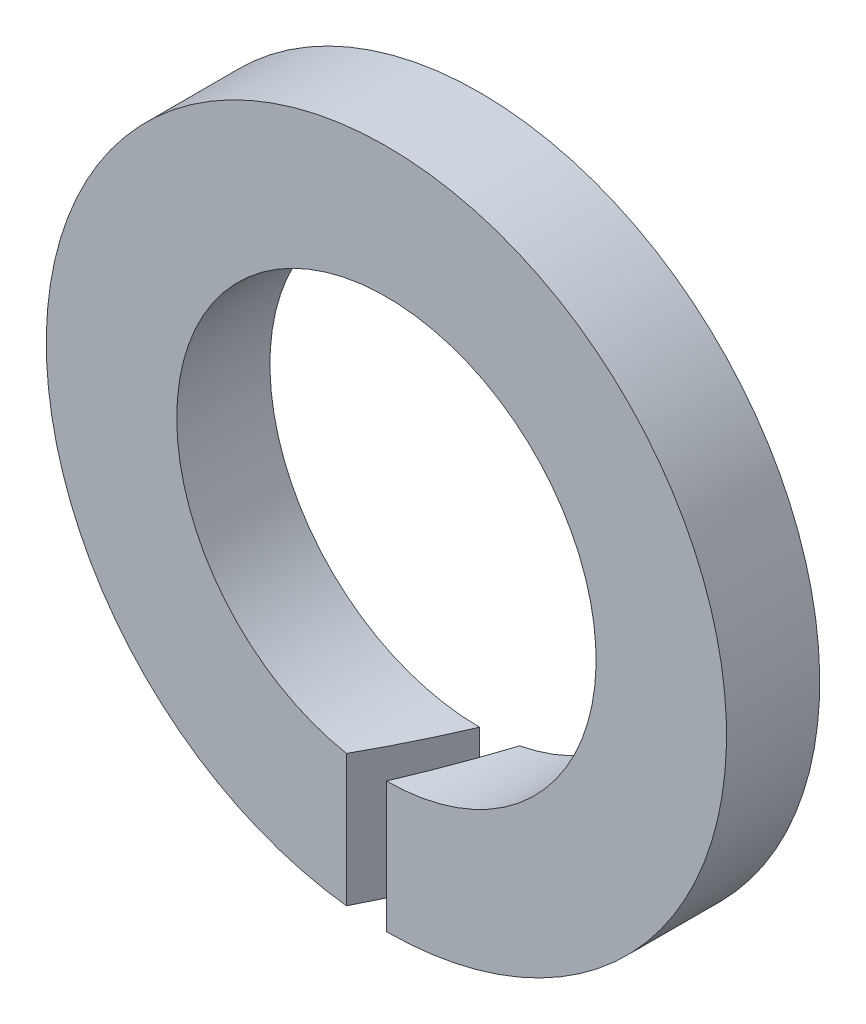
ISO-10303-21;
HEADER;
FILE_DESCRIPTION(('STEP AP214'),'2;1');
FILE_NAME('part.step','',(''),(''),'','','');
FILE_SCHEMA(('AUTOMOTIVE_DESIGN { 1 0 10303 214 1 1 1 1 }'));
ENDSEC;
DATA;
#1=APPLICATION_CONTEXT('core data for automotive mechanical design processes');
#2=APPLICATION_PROTOCOL_DEFINITION('international standard','automotive_design',2000,#1);
#3=PRODUCT_CONTEXT('',#1,'mechanical');
#4=PRODUCT('Part','Part','',(#3));
#5=PRODUCT_RELATED_PRODUCT_CATEGORY('part','',(#4));
#6=PRODUCT_DEFINITION_FORMATION('','',#4);
#7=PRODUCT_DEFINITION_CONTEXT('part definition',#1,'design');
#8=PRODUCT_DEFINITION('design','',#6,#7);
#9=PRODUCT_DEFINITION_SHAPE('','',#8);
#10=(LENGTH_UNIT() NAMED_UNIT(*) SI_UNIT(.MILLI.,.METRE.));
#11=(NAMED_UNIT(*) PLANE_ANGLE_UNIT() SI_UNIT($,.RADIAN.));
#12=(NAMED_UNIT(*) SI_UNIT($,.STERADIAN.) SOLID_ANGLE_UNIT());
#13=UNCERTAINTY_MEASURE_WITH_UNIT(LENGTH_MEASURE(1.E-05),#10,'distance_accuracy_value','');
#14=(GEOMETRIC_REPRESENTATION_CONTEXT(3) GLOBAL_UNCERTAINTY_ASSIGNED_CONTEXT((#13)) GLOBAL_UNIT_ASSIGNED_CONTEXT((#10,
#11,#12)) REPRESENTATION_CONTEXT('',''));
#15=CARTESIAN_POINT('',(0.,0.,0.));
#16=DIRECTION('',(0.,0.,1.));
#17=DIRECTION('',(1.,0.,0.));
#18=AXIS2_PLACEMENT_3D('',#15,#16,#17);
#19=CARTESIAN_POINT('',(0.,0.,0.));
#20=DIRECTION('',(0.,0.,-1.));
#21=DIRECTION('',(0.,1.,0.));
#22=AXIS2_PLACEMENT_3D('',#19,#20,#21);
#23=CYLINDRICAL_SURFACE('',#22,2.25);
#24=CARTESIAN_POINT('',(0.,0.,1.));
#25=DIRECTION('',(0.,0.,-1.));
#26=DIRECTION('',(0.,1.,0.));
#27=AXIS2_PLACEMENT_3D('',#24,#25,#26);
#28=CIRCLE('',#27,2.25);
#29=CARTESIAN_POINT('',(-0.429411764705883,-2.2086433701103,1.));
#30=VERTEX_POINT('',#29);
#31=CARTESIAN_POINT('',(0.,-2.25,1.));
#32=VERTEX_POINT('',#31);
#33=EDGE_CURVE('E11',#30,#32,#28,.T.);
#34=ORIENTED_EDGE('',*,*,#33,.F.);
#35=CARTESIAN_POINT('',(0.,0.,0.));
#36=DIRECTION('',(-0.918865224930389,0.,-0.394571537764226));
#37=DIRECTION('',(0.394571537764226,0.,-0.918865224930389));
#38=AXIS2_PLACEMENT_3D('',#35,#36,#37);
#39=ELLIPSE('',#38,5.70238799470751,2.25);
#40=CARTESIAN_POINT('',(0.,-2.25,0.));
#41=VERTEX_POINT('',#40);
#42=EDGE_CURVE('E79',#30,#41,#39,.F.);
#43=ORIENTED_EDGE('',*,*,#42,.T.);
#44=CARTESIAN_POINT('',(0.,0.,0.));
#45=DIRECTION('',(0.,0.,-1.));
#46=DIRECTION('',(0.,1.,0.));
#47=AXIS2_PLACEMENT_3D('',#44,#45,#46);
#48=CIRCLE('',#47,2.25);
#49=CARTESIAN_POINT('',(0.429411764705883,-2.2086433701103,0.));
#50=VERTEX_POINT('',#49);
#51=EDGE_CURVE('E74',#41,#50,#48,.T.);
#52=ORIENTED_EDGE('',*,*,#51,.T.);
#53=CARTESIAN_POINT('',(0.,0.,1.));
#54=DIRECTION('',(-0.918865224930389,0.,-0.394571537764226));
#55=DIRECTION('',(0.394571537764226,0.,-0.918865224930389));
#56=AXIS2_PLACEMENT_3D('',#53,#54,#55);
#57=ELLIPSE('',#56,5.70238799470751,2.25);
#58=EDGE_CURVE('E31',#32,#50,#57,.F.);
#59=ORIENTED_EDGE('',*,*,#58,.F.);
#60=EDGE_LOOP('',(#34,#43,#52,#59));
#61=FACE_BOUND('',#60,.T.);
#62=ADVANCED_FACE('F17',(#61),#23,.F.);
#63=CARTESIAN_POINT('',(3.65,0.,1.));
#64=DIRECTION('',(0.,0.,1.));
#65=DIRECTION('',(0.,-1.,0.));
#66=AXIS2_PLACEMENT_3D('',#63,#64,#65);
#67=PLANE('',#66);
#68=DIRECTION('',(0.,1.,0.));
#69=VECTOR('',#68,1.);
#70=CARTESIAN_POINT('',(-0.429411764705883,-3.79,1.));
#71=LINE('',#70,#69);
#72=CARTESIAN_POINT('',(-0.429411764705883,-3.62465247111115,1.));
#73=VERTEX_POINT('',#72);
#74=EDGE_CURVE('E64',#73,#30,#71,.T.);
#75=ORIENTED_EDGE('',*,*,#74,.T.);
#76=ORIENTED_EDGE('',*,*,#33,.T.);
#77=DIRECTION('',(0.,1.,0.));
#78=VECTOR('',#77,1.);
#79=CARTESIAN_POINT('',(0.,-3.79,1.));
#80=LINE('',#79,#78);
#81=CARTESIAN_POINT('',(0.,-3.65,1.));
#82=VERTEX_POINT('',#81);
#83=EDGE_CURVE('E58',#82,#32,#80,.T.);
#84=ORIENTED_EDGE('',*,*,#83,.F.);
#85=CARTESIAN_POINT('',(0.,0.,1.));
#86=DIRECTION('',(0.,0.,-1.));
#87=DIRECTION('',(0.,1.,0.));
#88=AXIS2_PLACEMENT_3D('',#85,#86,#87);
#89=CIRCLE('',#88,3.65);
#90=EDGE_CURVE('E24',#73,#82,#89,.T.);
#91=ORIENTED_EDGE('',*,*,#90,.F.);
#92=EDGE_LOOP('',(#75,#76,#84,#91));
#93=FACE_BOUND('',#92,.T.);
#94=ADVANCED_FACE('F69',(#93),#67,.T.);
#95=CARTESIAN_POINT('',(0.,0.,0.));
#96=DIRECTION('',(0.,0.,-1.));
#97=DIRECTION('',(0.,1.,0.));
#98=AXIS2_PLACEMENT_3D('',#95,#96,#97);
#99=CYLINDRICAL_SURFACE('',#98,3.65);
#100=CARTESIAN_POINT('',(0.,0.,0.));
#101=DIRECTION('',(-0.918865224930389,0.,-0.394571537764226));
#102=DIRECTION('',(0.394571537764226,0.,-0.918865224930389));
#103=AXIS2_PLACEMENT_3D('',#100,#101,#102);
#104=ELLIPSE('',#103,9.25054052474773,3.65);
#105=CARTESIAN_POINT('',(0.,-3.65,0.));
#106=VERTEX_POINT('',#105);
#107=EDGE_CURVE('E39',#73,#106,#104,.F.);
#108=ORIENTED_EDGE('',*,*,#107,.F.);
#109=ORIENTED_EDGE('',*,*,#90,.T.);
#110=CARTESIAN_POINT('',(0.,0.,1.));
#111=DIRECTION('',(-0.918865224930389,0.,-0.394571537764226));
#112=DIRECTION('',(0.394571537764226,0.,-0.918865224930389));
#113=AXIS2_PLACEMENT_3D('',#110,#111,#112);
#114=ELLIPSE('',#113,9.25054052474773,3.65);
#115=CARTESIAN_POINT('',(0.429411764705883,-3.62465247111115,0.));
#116=VERTEX_POINT('',#115);
#117=EDGE_CURVE('E55',#82,#116,#114,.F.);
#118=ORIENTED_EDGE('',*,*,#117,.T.);
#119=CARTESIAN_POINT('',(0.,0.,0.));
#120=DIRECTION('',(0.,0.,-1.));
#121=DIRECTION('',(0.,1.,0.));
#122=AXIS2_PLACEMENT_3D('',#119,#120,#121);
#123=CIRCLE('',#122,3.65);
#124=EDGE_CURVE('E73',#106,#116,#123,.T.);
#125=ORIENTED_EDGE('',*,*,#124,.F.);
#126=EDGE_LOOP('',(#108,#109,#118,#125));
#127=FACE_BOUND('',#126,.T.);
#128=ADVANCED_FACE('F72',(#127),#99,.T.);
#129=CARTESIAN_POINT('',(2.25,0.,0.));
#130=DIRECTION('',(0.,0.,-1.));
#131=DIRECTION('',(0.,1.,0.));
#132=AXIS2_PLACEMENT_3D('',#129,#130,#131);
#133=PLANE('',#132);
#134=DIRECTION('',(0.,1.,0.));
#135=VECTOR('',#134,1.);
#136=CARTESIAN_POINT('',(0.,-3.79,0.));
#137=LINE('',#136,#135);
#138=EDGE_CURVE('E84',#106,#41,#137,.T.);
#139=ORIENTED_EDGE('',*,*,#138,.F.);
#140=ORIENTED_EDGE('',*,*,#124,.T.);
#141=DIRECTION('',(0.,1.,0.));
#142=VECTOR('',#141,1.);
#143=CARTESIAN_POINT('',(0.429411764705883,-3.79,0.));
#144=LINE('',#143,#142);
#145=EDGE_CURVE('E59',#116,#50,#144,.T.);
#146=ORIENTED_EDGE('',*,*,#145,.T.);
#147=ORIENTED_EDGE('',*,*,#51,.F.);
#148=EDGE_LOOP('',(#139,#140,#146,#147));
#149=FACE_BOUND('',#148,.T.);
#150=ADVANCED_FACE('F90',(#149),#133,.T.);
#151=CARTESIAN_POINT('',(0.429411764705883,-3.79,0.));
#152=DIRECTION('',(-0.918865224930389,0.,-0.394571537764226));
#153=DIRECTION('',(0.394571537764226,0.,-0.918865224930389));
#154=AXIS2_PLACEMENT_3D('',#151,#152,#153);
#155=PLANE('',#154);
#156=ORIENTED_EDGE('',*,*,#58,.T.);
#157=ORIENTED_EDGE('',*,*,#145,.F.);
#158=ORIENTED_EDGE('',*,*,#117,.F.);
#159=ORIENTED_EDGE('',*,*,#83,.T.);
#160=EDGE_LOOP('',(#156,#157,#158,#159));
#161=FACE_BOUND('',#160,.T.);
#162=ADVANCED_FACE('F57',(#161),#155,.T.);
#163=CARTESIAN_POINT('',(0.,-3.79,0.));
#164=DIRECTION('',(-0.918865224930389,0.,-0.394571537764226));
#165=DIRECTION('',(0.394571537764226,0.,-0.918865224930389));
#166=AXIS2_PLACEMENT_3D('',#163,#164,#165);
#167=PLANE('',#166);
#168=ORIENTED_EDGE('',*,*,#74,.F.);
#169=ORIENTED_EDGE('',*,*,#107,.T.);
#170=ORIENTED_EDGE('',*,*,#138,.T.);
#171=ORIENTED_EDGE('',*,*,#42,.F.);
#172=EDGE_LOOP('',(#168,#169,#170,#171));
#173=FACE_BOUND('',#172,.T.);
#174=ADVANCED_FACE('F91',(#173),#167,.F.);
#175=CLOSED_SHELL('',(#62,#94,#128,#150,#162,#174));
#176=MANIFOLD_SOLID_BREP('B1',#175);
#177=ADVANCED_BREP_SHAPE_REPRESENTATION('',(#18,#176),#14);
#178=SHAPE_DEFINITION_REPRESENTATION(#9,#177);
ENDSEC;
END-ISO-10303-21;
